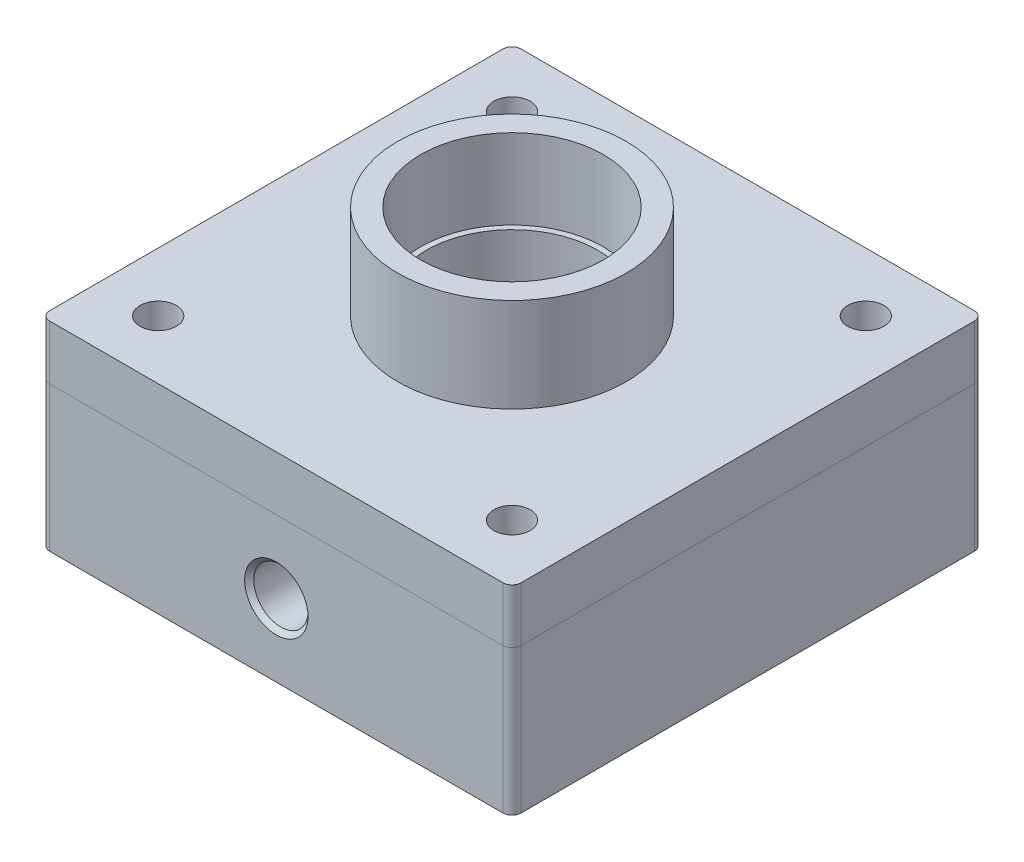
from build123d import *

# Parameters (mm, degrees)
SKETCH1_W                              = 165.1
SKETCH1_H                              = 165.1
BOSS_EXTRUDE1_DEPTH                    = 50.8
SKETCH2_R                              = 40
BOSS_EXTRUDE2_DEPTH                    = 52
SKETCH3_R                              = 32
CUT_EXTRUDE1_DEPTH                     = 28
SKETCH4_R                              = 30
CUT_EXTRUDE2_DEPTH                     = 22
FILLET1_R                              = 3.175
SKETCH5_R                              = 20
CUT_EXTRUDE3_DEPTH                     = 40
SKETCH6_R                              = 76.2
SKETCH6_R_2                            = 69.85
CUT_EXTRUDE4_DEPTH                     = 8
F_1_2_14_NPSM_TAPPED_HOLE1_D           = 18.9738
F_1_2_14_NPSM_TAPPED_HOLE1_DEPTH       = 47.24
F_1_2_14_NPSM_TAPPED_HOLE1_CSINK_D     = 22.1742
F_1_2_14_NPSM_TAPPED_HOLE1_CSINK_ANGLE = 90
F_1_2_14_NPSM_TAPPED_HOLE1_TIP         = 5.700304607
SKETCH10_R                             = 6.35
CUT_EXTRUDE5_DEPTH                     = 25
SKETCH11_R                             = 6.35
CUT_EXTRUDE6_DEPTH                     = 156.553350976
SKETCH12_R                             = 40
SKETCH12_R_2                           = 6.35
BOSS_EXTRUDE3_DEPTH                    = 19.05


with BuildPart() as part:
    # Sketch1 → Boss-Extrude1 (new body)
    with BuildSketch(Plane(origin=(0, 0, 0), x_dir=(1, 0, 0), z_dir=(0, 1, 0))):
        Rectangle(SKETCH1_W, SKETCH1_H)
    extrude(amount=BOSS_EXTRUDE1_DEPTH)

    # Sketch2 → Boss-Extrude2 (add)
    with BuildSketch(Plane(origin=(0, 50.8, 0), x_dir=(1, 0, 0), z_dir=(0, 1, 0))):
        with Locations(Location((0, 0, 0), (0, 0, 90))):
            Circle(SKETCH2_R)
    extrude(amount=BOSS_EXTRUDE2_DEPTH)

    # Sketch3 → Cut-Extrude1 (cut)
    with BuildSketch(Plane(origin=(0, 102.8, 0), x_dir=(1, 0, 0), z_dir=(0, 1, 0))):
        with Locations(Location((0, 0, 0), (0, 0, 270))):
            Circle(SKETCH3_R)
    extrude(amount=-CUT_EXTRUDE1_DEPTH, mode=Mode.SUBTRACT)

    # Sketch4 → Cut-Extrude2 (cut)
    with BuildSketch(Plane(origin=(0, 74.8, 0), x_dir=(1, 0, 0), z_dir=(0, 1, 0))):
        with Locations(Location((0, 0, 0), (0, 0, 270))):
            Circle(SKETCH4_R)
    extrude(amount=-CUT_EXTRUDE2_DEPTH, mode=Mode.SUBTRACT)

    # Fillet1
    fillet1_edges = [part.edges().sort_by_distance(p)[0] for p in [
        (82.55, 25.4, 82.55),
        (-82.55, 25.4, 82.55),
        (-82.55, 25.4, -82.55),
        (82.55, 25.4, -82.55),
    ]]
    fillet(fillet1_edges, radius=FILLET1_R)

    # Sketch5 → Cut-Extrude3 (cut)
    with BuildSketch(Plane.XZ):
        with Locations(Location((0, 0, 0), (0, 0, 270))):
            Circle(SKETCH5_R)
    extrude(amount=-CUT_EXTRUDE3_DEPTH, mode=Mode.SUBTRACT)

    # Sketch6 → Cut-Extrude4 (cut)
    with BuildSketch(Plane.XZ):
        with Locations(Location((0, 0, 0), (0, 0, 270))):
            Circle(SKETCH6_R)
        with Locations(Location((0, 0, 0), (0, 0, 270))):
            Circle(SKETCH6_R_2, mode=Mode.SUBTRACT)
    extrude(amount=-CUT_EXTRUDE4_DEPTH, mode=Mode.SUBTRACT)

    # 1_2-14 NPSM Tapped Hole1
    with Locations(Plane.XY.offset(82.55)):
        with Locations((0, 25.4)):
            CounterSinkHole(F_1_2_14_NPSM_TAPPED_HOLE1_D / 2, F_1_2_14_NPSM_TAPPED_HOLE1_CSINK_D / 2, depth=F_1_2_14_NPSM_TAPPED_HOLE1_DEPTH, counter_sink_angle=F_1_2_14_NPSM_TAPPED_HOLE1_CSINK_ANGLE)
            with Locations((0, 0, -(F_1_2_14_NPSM_TAPPED_HOLE1_DEPTH + F_1_2_14_NPSM_TAPPED_HOLE1_TIP / 2))):  # 118° drill point
                Cone(0, F_1_2_14_NPSM_TAPPED_HOLE1_D / 2, F_1_2_14_NPSM_TAPPED_HOLE1_TIP, mode=Mode.SUBTRACT)

    # Sketch10 → Cut-Extrude5 (cut)
    with BuildSketch(Plane.XZ):
        with Locations(Location((0, 50.55, 0), (0, 0, 270))):
            Circle(SKETCH10_R)
    extrude(amount=-CUT_EXTRUDE5_DEPTH, mode=Mode.SUBTRACT)

    # Sketch11 → Cut-Extrude6 (cut, through all)
    with BuildSketch(Plane.XZ):
        with Locations(Location((-61.963767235, 61.963767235, 0), (0, 0, 270))):
            Circle(SKETCH11_R)
        with Locations(Location((61.963767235, 61.963767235, 0), (0, 0, 270))):
            Circle(SKETCH11_R)
        with Locations(Location((61.963767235, -61.963767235, 0), (0, 0, 270))):
            Circle(SKETCH11_R)
        with Locations(Location((-61.963767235, -61.963767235, 0), (0, 0, 270))):
            Circle(SKETCH11_R)
    extrude(amount=-CUT_EXTRUDE6_DEPTH, mode=Mode.SUBTRACT)


with BuildPart() as body_2:
    # Sketch12 → Boss-Extrude3 (new body)
    with BuildSketch(Plane(origin=(0, 50.8, 0), x_dir=(1, 0, 0), z_dir=(0, 1, 0))):
        with BuildLine():
            Line((-82.55, 79.375), (-82.55, -79.375))
            ThreePointArc((-82.55, -79.375), (-81.62006403, -81.62006403), (-79.375, -82.55))
            Line((-79.375, -82.55), (79.375, -82.55))
            ThreePointArc((79.375, -82.55), (81.62006403, -81.62006403), (82.55, -79.375))
            Line((82.55, -79.375), (82.55, 79.375))
            ThreePointArc((82.55, 79.375), (81.62006403, 81.62006403), (79.375, 82.55))
            Line((79.375, 82.55), (-79.375, 82.55))
            ThreePointArc((-79.375, 82.55), (-81.62006403, 81.62006403), (-82.55, 79.375))
        make_face()
        with Locations(Location((0, 0, 0), (0, 0, 90))):
            Circle(SKETCH12_R, mode=Mode.SUBTRACT)
        with Locations(Location((61.963767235, -61.963767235, 0), (0, 0, 90))):
            Circle(SKETCH12_R_2, mode=Mode.SUBTRACT)
        with Locations(Location((61.963767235, 61.963767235, 0), (0, 0, 90))):
            Circle(SKETCH12_R_2, mode=Mode.SUBTRACT)
        with Locations(Location((-61.963767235, 61.963767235, 0), (0, 0, 90))):
            Circle(SKETCH12_R_2, mode=Mode.SUBTRACT)
        with Locations(Location((-61.963767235, -61.963767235, 0), (0, 0, 90))):
            Circle(SKETCH12_R_2, mode=Mode.SUBTRACT)
    extrude(amount=BOSS_EXTRUDE3_DEPTH)


solid = Compound([part.part, body_2.part])
